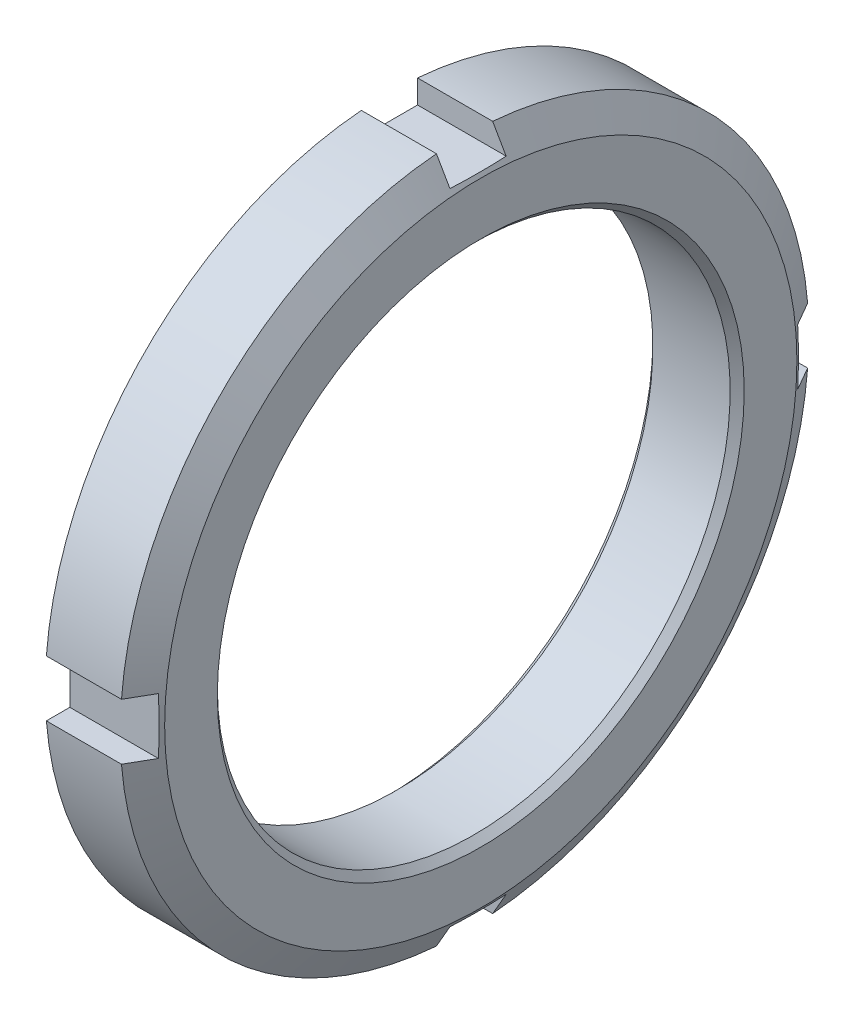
ISO-10303-21;
HEADER;
FILE_DESCRIPTION(('STEP AP214'),'2;1');
FILE_NAME('part.step','',(''),(''),'','','');
FILE_SCHEMA(('AUTOMOTIVE_DESIGN { 1 0 10303 214 1 1 1 1 }'));
ENDSEC;
DATA;
#1=APPLICATION_CONTEXT('core data for automotive mechanical design processes');
#2=APPLICATION_PROTOCOL_DEFINITION('international standard','automotive_design',2000,#1);
#3=PRODUCT_CONTEXT('',#1,'mechanical');
#4=PRODUCT('Part','Part','',(#3));
#5=PRODUCT_RELATED_PRODUCT_CATEGORY('part','',(#4));
#6=PRODUCT_DEFINITION_FORMATION('','',#4);
#7=PRODUCT_DEFINITION_CONTEXT('part definition',#1,'design');
#8=PRODUCT_DEFINITION('design','',#6,#7);
#9=PRODUCT_DEFINITION_SHAPE('','',#8);
#10=(LENGTH_UNIT() NAMED_UNIT(*) SI_UNIT(.MILLI.,.METRE.));
#11=(NAMED_UNIT(*) PLANE_ANGLE_UNIT() SI_UNIT($,.RADIAN.));
#12=(NAMED_UNIT(*) SI_UNIT($,.STERADIAN.) SOLID_ANGLE_UNIT());
#13=UNCERTAINTY_MEASURE_WITH_UNIT(LENGTH_MEASURE(1.E-05),#10,'distance_accuracy_value','');
#14=(GEOMETRIC_REPRESENTATION_CONTEXT(3) GLOBAL_UNCERTAINTY_ASSIGNED_CONTEXT((#13)) GLOBAL_UNIT_ASSIGNED_CONTEXT((#10,
#11,#12)) REPRESENTATION_CONTEXT('',''));
#15=CARTESIAN_POINT('',(0.,0.,0.));
#16=DIRECTION('',(0.,0.,1.));
#17=DIRECTION('',(1.,0.,0.));
#18=AXIS2_PLACEMENT_3D('',#15,#16,#17);
#19=CARTESIAN_POINT('',(13.,0.,0.));
#20=DIRECTION('',(-1.,0.,0.));
#21=DIRECTION('',(0.,0.,1.));
#22=AXIS2_PLACEMENT_3D('',#19,#20,#21);
#23=CYLINDRICAL_SURFACE('',#22,49.);
#24=CARTESIAN_POINT('',(0.,0.,0.));
#25=DIRECTION('',(-1.,0.,0.));
#26=DIRECTION('',(0.,0.,1.));
#27=AXIS2_PLACEMENT_3D('',#24,#25,#26);
#28=CIRCLE('',#27,49.);
#29=CARTESIAN_POINT('',(0.,4.,48.8364617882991));
#30=VERTEX_POINT('',#29);
#31=CARTESIAN_POINT('',(0.,48.8364617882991,4.));
#32=VERTEX_POINT('',#31);
#33=EDGE_CURVE('E250',#30,#32,#28,.T.);
#34=ORIENTED_EDGE('',*,*,#33,.F.);
#35=DIRECTION('',(-1.,0.,0.));
#36=VECTOR('',#35,1.);
#37=CARTESIAN_POINT('',(13.,4.,48.8364617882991));
#38=LINE('',#37,#36);
#39=CARTESIAN_POINT('',(10.6905989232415,4.,48.8364617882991));
#40=VERTEX_POINT('',#39);
#41=EDGE_CURVE('E153',#30,#40,#38,.F.);
#42=ORIENTED_EDGE('',*,*,#41,.T.);
#43=CARTESIAN_POINT('',(10.6905989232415,0.,0.));
#44=DIRECTION('',(-1.,0.,0.));
#45=DIRECTION('',(0.,0.,1.));
#46=AXIS2_PLACEMENT_3D('',#43,#44,#45);
#47=CIRCLE('',#46,49.);
#48=CARTESIAN_POINT('',(10.6905989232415,48.8364617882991,4.));
#49=VERTEX_POINT('',#48);
#50=EDGE_CURVE('E245',#40,#49,#47,.T.);
#51=ORIENTED_EDGE('',*,*,#50,.T.);
#52=DIRECTION('',(-1.,0.,0.));
#53=VECTOR('',#52,1.);
#54=CARTESIAN_POINT('',(13.,48.8364617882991,4.));
#55=LINE('',#54,#53);
#56=EDGE_CURVE('E166',#49,#32,#55,.T.);
#57=ORIENTED_EDGE('',*,*,#56,.T.);
#58=EDGE_LOOP('',(#34,#42,#51,#57));
#59=FACE_BOUND('',#58,.T.);
#60=ADVANCED_FACE('F30',(#59),#23,.T.);
#61=CARTESIAN_POINT('',(10.6905989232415,-48.8364617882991,4.));
#62=VERTEX_POINT('',#61);
#63=CARTESIAN_POINT('',(10.6905989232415,-4.,48.8364617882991));
#64=VERTEX_POINT('',#63);
#65=EDGE_CURVE('E244',#62,#64,#47,.T.);
#66=ORIENTED_EDGE('',*,*,#65,.T.);
#67=DIRECTION('',(-1.,0.,0.));
#68=VECTOR('',#67,1.);
#69=CARTESIAN_POINT('',(13.,-4.,48.8364617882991));
#70=LINE('',#69,#68);
#71=CARTESIAN_POINT('',(0.,-4.,48.8364617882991));
#72=VERTEX_POINT('',#71);
#73=EDGE_CURVE('E50',#64,#72,#70,.T.);
#74=ORIENTED_EDGE('',*,*,#73,.T.);
#75=CARTESIAN_POINT('',(0.,-48.8364617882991,4.));
#76=VERTEX_POINT('',#75);
#77=EDGE_CURVE('E248',#76,#72,#28,.T.);
#78=ORIENTED_EDGE('',*,*,#77,.F.);
#79=DIRECTION('',(-1.,0.,0.));
#80=VECTOR('',#79,1.);
#81=CARTESIAN_POINT('',(13.,-48.8364617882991,4.));
#82=LINE('',#81,#80);
#83=EDGE_CURVE('E224',#76,#62,#82,.F.);
#84=ORIENTED_EDGE('',*,*,#83,.T.);
#85=EDGE_LOOP('',(#66,#74,#78,#84));
#86=FACE_BOUND('',#85,.T.);
#87=ADVANCED_FACE('F370',(#86),#23,.T.);
#88=CARTESIAN_POINT('',(10.6905989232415,-4.,-48.8364617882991));
#89=VERTEX_POINT('',#88);
#90=CARTESIAN_POINT('',(10.6905989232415,-48.8364617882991,-4.));
#91=VERTEX_POINT('',#90);
#92=EDGE_CURVE('E372',#89,#91,#47,.T.);
#93=ORIENTED_EDGE('',*,*,#92,.T.);
#94=DIRECTION('',(-1.,0.,0.));
#95=VECTOR('',#94,1.);
#96=CARTESIAN_POINT('',(13.,-48.8364617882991,-4.));
#97=LINE('',#96,#95);
#98=CARTESIAN_POINT('',(0.,-48.8364617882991,-4.));
#99=VERTEX_POINT('',#98);
#100=EDGE_CURVE('E58',#91,#99,#97,.T.);
#101=ORIENTED_EDGE('',*,*,#100,.T.);
#102=CARTESIAN_POINT('',(0.,-4.,-48.8364617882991));
#103=VERTEX_POINT('',#102);
#104=EDGE_CURVE('E392',#103,#99,#28,.T.);
#105=ORIENTED_EDGE('',*,*,#104,.F.);
#106=DIRECTION('',(-1.,0.,0.));
#107=VECTOR('',#106,1.);
#108=CARTESIAN_POINT('',(13.,-4.,-48.8364617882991));
#109=LINE('',#108,#107);
#110=EDGE_CURVE('E220',#103,#89,#109,.F.);
#111=ORIENTED_EDGE('',*,*,#110,.T.);
#112=EDGE_LOOP('',(#93,#101,#105,#111));
#113=FACE_BOUND('',#112,.T.);
#114=ADVANCED_FACE('F401',(#113),#23,.T.);
#115=CARTESIAN_POINT('',(0.,0.,0.));
#116=DIRECTION('',(1.,0.,0.));
#117=DIRECTION('',(0.,0.,-1.));
#118=AXIS2_PLACEMENT_3D('',#115,#116,#117);
#119=PLANE('',#118);
#120=DIRECTION('',(0.,-1.,0.));
#121=VECTOR('',#120,1.);
#122=CARTESIAN_POINT('',(0.,4.,45.5));
#123=LINE('',#122,#121);
#124=CARTESIAN_POINT('',(0.,4.,45.5));
#125=VERTEX_POINT('',#124);
#126=CARTESIAN_POINT('',(0.,-4.,45.5));
#127=VERTEX_POINT('',#126);
#128=EDGE_CURVE('E158',#125,#127,#123,.T.);
#129=ORIENTED_EDGE('',*,*,#128,.F.);
#130=DIRECTION('',(0.,0.,-1.));
#131=VECTOR('',#130,1.);
#132=CARTESIAN_POINT('',(0.,4.,49.));
#133=LINE('',#132,#131);
#134=EDGE_CURVE('E148',#30,#125,#133,.T.);
#135=ORIENTED_EDGE('',*,*,#134,.F.);
#136=ORIENTED_EDGE('',*,*,#33,.T.);
#137=DIRECTION('',(0.,1.,0.));
#138=VECTOR('',#137,1.);
#139=CARTESIAN_POINT('',(0.,45.5,4.));
#140=LINE('',#139,#138);
#141=CARTESIAN_POINT('',(0.,45.5,4.));
#142=VERTEX_POINT('',#141);
#143=EDGE_CURVE('E194',#142,#32,#140,.T.);
#144=ORIENTED_EDGE('',*,*,#143,.F.);
#145=DIRECTION('',(0.,0.,1.));
#146=VECTOR('',#145,1.);
#147=CARTESIAN_POINT('',(0.,45.5,-4.));
#148=LINE('',#147,#146);
#149=CARTESIAN_POINT('',(0.,45.5,-4.));
#150=VERTEX_POINT('',#149);
#151=EDGE_CURVE('E191',#150,#142,#148,.T.);
#152=ORIENTED_EDGE('',*,*,#151,.F.);
#153=DIRECTION('',(0.,-1.,0.));
#154=VECTOR('',#153,1.);
#155=CARTESIAN_POINT('',(0.,49.,-4.));
#156=LINE('',#155,#154);
#157=CARTESIAN_POINT('',(0.,48.8364617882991,-4.));
#158=VERTEX_POINT('',#157);
#159=EDGE_CURVE('E189',#158,#150,#156,.T.);
#160=ORIENTED_EDGE('',*,*,#159,.F.);
#161=CARTESIAN_POINT('',(0.,4.,-48.8364617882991));
#162=VERTEX_POINT('',#161);
#163=EDGE_CURVE('E253',#158,#162,#28,.T.);
#164=ORIENTED_EDGE('',*,*,#163,.T.);
#165=DIRECTION('',(0.,0.,-1.));
#166=VECTOR('',#165,1.);
#167=CARTESIAN_POINT('',(0.,4.,-45.5));
#168=LINE('',#167,#166);
#169=CARTESIAN_POINT('',(0.,4.,-45.5));
#170=VERTEX_POINT('',#169);
#171=EDGE_CURVE('E187',#170,#162,#168,.T.);
#172=ORIENTED_EDGE('',*,*,#171,.F.);
#173=DIRECTION('',(0.,1.,0.));
#174=VECTOR('',#173,1.);
#175=CARTESIAN_POINT('',(0.,-4.,-45.5));
#176=LINE('',#175,#174);
#177=CARTESIAN_POINT('',(0.,-4.,-45.5));
#178=VERTEX_POINT('',#177);
#179=EDGE_CURVE('E184',#178,#170,#176,.T.);
#180=ORIENTED_EDGE('',*,*,#179,.F.);
#181=DIRECTION('',(0.,0.,1.));
#182=VECTOR('',#181,1.);
#183=CARTESIAN_POINT('',(0.,-4.,-49.));
#184=LINE('',#183,#182);
#185=EDGE_CURVE('E182',#103,#178,#184,.T.);
#186=ORIENTED_EDGE('',*,*,#185,.F.);
#187=ORIENTED_EDGE('',*,*,#104,.T.);
#188=DIRECTION('',(0.,-1.,0.));
#189=VECTOR('',#188,1.);
#190=CARTESIAN_POINT('',(0.,-45.5,-4.));
#191=LINE('',#190,#189);
#192=CARTESIAN_POINT('',(0.,-45.5,-4.));
#193=VERTEX_POINT('',#192);
#194=EDGE_CURVE('E180',#193,#99,#191,.T.);
#195=ORIENTED_EDGE('',*,*,#194,.F.);
#196=DIRECTION('',(0.,0.,-1.));
#197=VECTOR('',#196,1.);
#198=CARTESIAN_POINT('',(0.,-45.5,4.));
#199=LINE('',#198,#197);
#200=CARTESIAN_POINT('',(0.,-45.5,4.));
#201=VERTEX_POINT('',#200);
#202=EDGE_CURVE('E177',#201,#193,#199,.T.);
#203=ORIENTED_EDGE('',*,*,#202,.F.);
#204=DIRECTION('',(0.,1.,0.));
#205=VECTOR('',#204,1.);
#206=CARTESIAN_POINT('',(0.,-49.,4.));
#207=LINE('',#206,#205);
#208=EDGE_CURVE('E173',#76,#201,#207,.T.);
#209=ORIENTED_EDGE('',*,*,#208,.F.);
#210=ORIENTED_EDGE('',*,*,#77,.T.);
#211=DIRECTION('',(0.,0.,1.));
#212=VECTOR('',#211,1.);
#213=CARTESIAN_POINT('',(0.,-4.,45.5));
#214=LINE('',#213,#212);
#215=EDGE_CURVE('E171',#127,#72,#214,.T.);
#216=ORIENTED_EDGE('',*,*,#215,.F.);
#217=EDGE_LOOP('',(#129,#135,#136,#144,#152,#160,#164,#172,#180,#186,#187,#195,#203,#209,#210,#216));
#218=FACE_BOUND('',#217,.T.);
#219=CARTESIAN_POINT('',(0.,0.,0.));
#220=DIRECTION('',(-1.,0.,0.));
#221=DIRECTION('',(0.,0.,1.));
#222=AXIS2_PLACEMENT_3D('',#219,#220,#221);
#223=CIRCLE('',#222,37.5);
#224=CARTESIAN_POINT('',(0.,0.,37.5));
#225=VERTEX_POINT('',#224);
#226=EDGE_CURVE('E238',#225,#225,#223,.T.);
#227=ORIENTED_EDGE('',*,*,#226,.F.);
#228=EDGE_LOOP('',(#227));
#229=FACE_BOUND('',#228,.T.);
#230=ADVANCED_FACE('F32',(#218,#229),#119,.F.);
#231=CARTESIAN_POINT('',(13.,45.,0.));
#232=DIRECTION('',(-1.,0.,0.));
#233=DIRECTION('',(0.,0.,1.));
#234=AXIS2_PLACEMENT_3D('',#231,#232,#233);
#235=PLANE('',#234);
#236=CARTESIAN_POINT('',(13.,0.,0.));
#237=DIRECTION('',(-1.,0.,0.));
#238=DIRECTION('',(0.,0.,1.));
#239=AXIS2_PLACEMENT_3D('',#236,#237,#238);
#240=CIRCLE('',#239,45.);
#241=CARTESIAN_POINT('',(13.,0.,45.));
#242=VERTEX_POINT('',#241);
#243=EDGE_CURVE('E241',#242,#242,#240,.T.);
#244=ORIENTED_EDGE('',*,*,#243,.F.);
#245=EDGE_LOOP('',(#244));
#246=FACE_BOUND('',#245,.T.);
#247=CARTESIAN_POINT('',(13.,0.,0.));
#248=DIRECTION('',(-1.,0.,0.));
#249=DIRECTION('',(0.,0.,1.));
#250=AXIS2_PLACEMENT_3D('',#247,#248,#249);
#251=CIRCLE('',#250,37.5);
#252=CARTESIAN_POINT('',(13.,0.,37.5));
#253=VERTEX_POINT('',#252);
#254=EDGE_CURVE('E229',#253,#253,#251,.T.);
#255=ORIENTED_EDGE('',*,*,#254,.T.);
#256=EDGE_LOOP('',(#255));
#257=FACE_BOUND('',#256,.T.);
#258=ADVANCED_FACE('F407',(#246,#257),#235,.F.);
#259=CARTESIAN_POINT('',(10.6905989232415,48.8364617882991,-4.));
#260=VERTEX_POINT('',#259);
#261=CARTESIAN_POINT('',(10.6905989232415,4.,-48.8364617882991));
#262=VERTEX_POINT('',#261);
#263=EDGE_CURVE('E249',#260,#262,#47,.T.);
#264=ORIENTED_EDGE('',*,*,#263,.T.);
#265=DIRECTION('',(-1.,0.,0.));
#266=VECTOR('',#265,1.);
#267=CARTESIAN_POINT('',(13.,4.,-48.8364617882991));
#268=LINE('',#267,#266);
#269=EDGE_CURVE('E217',#262,#162,#268,.T.);
#270=ORIENTED_EDGE('',*,*,#269,.T.);
#271=ORIENTED_EDGE('',*,*,#163,.F.);
#272=DIRECTION('',(-1.,0.,0.));
#273=VECTOR('',#272,1.);
#274=CARTESIAN_POINT('',(13.,48.8364617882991,-4.));
#275=LINE('',#274,#273);
#276=EDGE_CURVE('E214',#158,#260,#275,.F.);
#277=ORIENTED_EDGE('',*,*,#276,.T.);
#278=EDGE_LOOP('',(#264,#270,#271,#277));
#279=FACE_BOUND('',#278,.T.);
#280=ADVANCED_FACE('F379',(#279),#23,.T.);
#281=CARTESIAN_POINT('',(13.,0.,0.));
#282=DIRECTION('',(-1.,0.,0.));
#283=DIRECTION('',(0.,0.,1.));
#284=AXIS2_PLACEMENT_3D('',#281,#282,#283);
#285=CONICAL_SURFACE('',#284,45.,1.0471975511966);
#286=ORIENTED_EDGE('',*,*,#50,.F.);
#287=CARTESIAN_POINT('',(7.66285743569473,4.,54.0965198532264));
#288=CARTESIAN_POINT('',(8.33743228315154,4.,52.9249278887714));
#289=CARTESIAN_POINT('',(9.01192138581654,4.,51.7532865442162));
#290=CARTESIAN_POINT('',(10.3606797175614,4.,49.4098773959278));
#291=CARTESIAN_POINT('',(11.0349489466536,4.,48.2381095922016));
#292=CARTESIAN_POINT('',(12.3832192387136,4.,45.8944196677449));
#293=CARTESIAN_POINT('',(13.0572203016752,4.,44.7224975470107));
#294=CARTESIAN_POINT('',(14.4048782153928,4.,42.3784553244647));
#295=CARTESIAN_POINT('',(15.0785350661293,4.,41.2063352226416));
#296=CARTESIAN_POINT('',(15.7519817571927,4.,40.0340943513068));
#297=B_SPLINE_CURVE_WITH_KNOTS('',3,(#287,#288,#289,#290,#291,#292,#293,#294,#295,#296),
.UNSPECIFIED.,.F.,.F.,(4,2,2,2,4),(0.,4.05575032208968,8.11150041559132,12.1672506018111,
16.223001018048),.UNSPECIFIED.);
#298=CARTESIAN_POINT('',(12.6100081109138,4.,45.5));
#299=VERTEX_POINT('',#298);
#300=EDGE_CURVE('E11',#40,#299,#297,.T.);
#301=ORIENTED_EDGE('',*,*,#300,.T.);
#302=CARTESIAN_POINT('',(11.6602653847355,12.9991778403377,45.5));
#303=CARTESIAN_POINT('',(11.765748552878,12.334181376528,45.5));
#304=CARTESIAN_POINT('',(11.8639087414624,11.6680083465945,45.5));
#305=CARTESIAN_POINT('',(12.0449590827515,10.3335596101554,45.5));
#306=CARTESIAN_POINT('',(12.1278484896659,9.66528380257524,45.5));
#307=CARTESIAN_POINT('',(12.2777398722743,8.32679221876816,45.5));
#308=CARTESIAN_POINT('',(12.3447382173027,7.65657603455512,45.5));
#309=CARTESIAN_POINT('',(12.4623039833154,6.31471161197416,45.5));
#310=CARTESIAN_POINT('',(12.5128716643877,5.6430633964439,45.5));
#311=CARTESIAN_POINT('',(12.5967702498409,4.30502342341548,45.5));
#312=CARTESIAN_POINT('',(12.630258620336,3.63864156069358,45.5));
#313=CARTESIAN_POINT('',(12.6804361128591,2.3052241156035,45.5));
#314=CARTESIAN_POINT('',(12.6971247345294,1.63818851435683,45.5));
#315=CARTESIAN_POINT('',(12.7135599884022,0.304026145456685,45.5));
#316=CARTESIAN_POINT('',(12.7133096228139,-0.363100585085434,45.5));
#317=CARTESIAN_POINT('',(12.6958767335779,-1.69715353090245,45.5));
#318=CARTESIAN_POINT('',(12.6786936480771,-2.36407973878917,45.5));
#319=CARTESIAN_POINT('',(12.6275573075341,-3.69672963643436,45.5));
#320=CARTESIAN_POINT('',(12.5936181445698,-4.36245386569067,45.5));
#321=CARTESIAN_POINT('',(12.5092599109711,-5.69286439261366,45.5));
#322=CARTESIAN_POINT('',(12.45884030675,-6.35755065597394,45.5));
#323=CARTESIAN_POINT('',(12.2834101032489,-8.34967587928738,45.5));
#324=CARTESIAN_POINT('',(12.1342333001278,-9.67504956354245,45.5));
#325=CARTESIAN_POINT('',(11.7741385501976,-12.3301774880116,45.5));
#326=CARTESIAN_POINT('',(11.5626446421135,-13.6598527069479,45.5));
#327=CARTESIAN_POINT('',(11.2038795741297,-15.6464494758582,45.5));
#328=CARTESIAN_POINT('',(11.0773985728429,-16.3072038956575,45.5));
#329=CARTESIAN_POINT('',(10.8113610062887,-17.6260365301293,45.5));
#330=CARTESIAN_POINT('',(10.6718052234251,-18.2841149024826,45.5));
#331=CARTESIAN_POINT('',(10.5260896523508,-18.9408329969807,45.5));
#332=B_SPLINE_CURVE_WITH_KNOTS('',3,(#302,#303,#304,#305,#306,#307,#308,#309,#310,#311,#312,
#313,#314,#315,#316,#317,#318,#319,#320,#321,#322,#323,#324,#325,#326,#327,#328,#329,#330,#331),
.UNSPECIFIED.,.F.,.F.,(4,2,2,2,2,2,2,2,2,2,2,2,2,2,4),(0.,2.019912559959,4.03992374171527,
6.06039599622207,8.08083626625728,10.0822957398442,12.083814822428,14.0849791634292,
16.0862099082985,18.0857604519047,20.0853757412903,24.0850013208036,28.1228191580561,
30.1409590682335,32.1589782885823),.UNSPECIFIED.);
#333=CARTESIAN_POINT('',(12.6100081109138,-4.,45.5));
#334=VERTEX_POINT('',#333);
#335=EDGE_CURVE('E43',#299,#334,#332,.T.);
#336=ORIENTED_EDGE('',*,*,#335,.T.);
#337=CARTESIAN_POINT('',(15.7519817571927,-4.,40.0340943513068));
#338=CARTESIAN_POINT('',(15.0785350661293,-4.,41.2063352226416));
#339=CARTESIAN_POINT('',(14.4048782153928,-4.,42.3784553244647));
#340=CARTESIAN_POINT('',(13.0572203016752,-4.,44.7224975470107));
#341=CARTESIAN_POINT('',(12.3832192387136,-4.,45.8944196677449));
#342=CARTESIAN_POINT('',(11.0349489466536,-4.,48.2381095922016));
#343=CARTESIAN_POINT('',(10.3606797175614,-4.,49.4098773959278));
#344=CARTESIAN_POINT('',(9.01192138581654,-4.,51.7532865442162));
#345=CARTESIAN_POINT('',(8.33743228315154,-4.,52.9249278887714));
#346=CARTESIAN_POINT('',(7.66285743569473,-4.,54.0965198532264));
#347=B_SPLINE_CURVE_WITH_KNOTS('',3,(#337,#338,#339,#340,#341,#342,#343,#344,#345,#346),
.UNSPECIFIED.,.F.,.F.,(4,2,2,2,4),(0.,4.05575041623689,8.11150060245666,12.1672506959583,
16.223001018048),.UNSPECIFIED.);
#348=EDGE_CURVE('E344',#334,#64,#347,.T.);
#349=ORIENTED_EDGE('',*,*,#348,.T.);
#350=ORIENTED_EDGE('',*,*,#65,.F.);
#351=CARTESIAN_POINT('',(6.90593146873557,-55.4110483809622,4.));
#352=CARTESIAN_POINT('',(7.58057111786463,-54.2394937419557,4.));
#353=CARTESIAN_POINT('',(8.25513078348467,-53.0678930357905,4.));
#354=CARTESIAN_POINT('',(9.60404651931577,-50.7245745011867,4.));
#355=CARTESIAN_POINT('',(10.2784025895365,-49.5528566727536,4.));
#356=CARTESIAN_POINT('',(11.6268675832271,-47.2092787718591,4.));
#357=CARTESIAN_POINT('',(12.3009765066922,-46.0374186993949,4.));
#358=CARTESIAN_POINT('',(13.6488794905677,-43.6935174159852,4.));
#359=CARTESIAN_POINT('',(14.322673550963,-42.521476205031,4.));
#360=CARTESIAN_POINT('',(14.9962762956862,-41.3493250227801,4.));
#361=B_SPLINE_CURVE_WITH_KNOTS('',3,(#351,#352,#353,#354,#355,#356,#357,#358,#359,#360),
.UNSPECIFIED.,.F.,.F.,(4,2,2,2,4),(0.,4.05575028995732,8.1115003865,12.1672505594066,
16.2230009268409),.UNSPECIFIED.);
#362=CARTESIAN_POINT('',(12.6100081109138,-45.5,4.));
#363=VERTEX_POINT('',#362);
#364=EDGE_CURVE('E338',#62,#363,#361,.T.);
#365=ORIENTED_EDGE('',*,*,#364,.T.);
#366=CARTESIAN_POINT('',(11.6602653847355,-45.5,12.9991778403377));
#367=CARTESIAN_POINT('',(11.765748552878,-45.5,12.334181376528));
#368=CARTESIAN_POINT('',(11.8639087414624,-45.5,11.6680083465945));
#369=CARTESIAN_POINT('',(12.0449590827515,-45.5,10.3335596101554));
#370=CARTESIAN_POINT('',(12.1278484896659,-45.5,9.66528380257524));
#371=CARTESIAN_POINT('',(12.2777398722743,-45.5,8.32679221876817));
#372=CARTESIAN_POINT('',(12.3447382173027,-45.5,7.65657603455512));
#373=CARTESIAN_POINT('',(12.4623039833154,-45.5,6.31471161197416));
#374=CARTESIAN_POINT('',(12.5128716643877,-45.5,5.6430633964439));
#375=CARTESIAN_POINT('',(12.5967702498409,-45.5,4.30502342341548));
#376=CARTESIAN_POINT('',(12.630258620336,-45.5,3.63864156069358));
#377=CARTESIAN_POINT('',(12.6804361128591,-45.5,2.3052241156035));
#378=CARTESIAN_POINT('',(12.6971247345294,-45.5,1.63818851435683));
#379=CARTESIAN_POINT('',(12.7135599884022,-45.5,0.304026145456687));
#380=CARTESIAN_POINT('',(12.7133096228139,-45.5,-0.363100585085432));
#381=CARTESIAN_POINT('',(12.6958767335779,-45.5,-1.69715353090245));
#382=CARTESIAN_POINT('',(12.6786936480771,-45.5,-2.36407973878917));
#383=CARTESIAN_POINT('',(12.6275573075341,-45.5,-3.69672963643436));
#384=CARTESIAN_POINT('',(12.5936181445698,-45.5,-4.36245386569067));
#385=CARTESIAN_POINT('',(12.5092599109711,-45.5,-5.69286439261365));
#386=CARTESIAN_POINT('',(12.45884030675,-45.5,-6.35755065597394));
#387=CARTESIAN_POINT('',(12.2834101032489,-45.5,-8.34967587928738));
#388=CARTESIAN_POINT('',(12.1342333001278,-45.5,-9.67504956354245));
#389=CARTESIAN_POINT('',(11.7741385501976,-45.5,-12.3301774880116));
#390=CARTESIAN_POINT('',(11.5626446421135,-45.5,-13.6598527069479));
#391=CARTESIAN_POINT('',(11.2038795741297,-45.5,-15.6464494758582));
#392=CARTESIAN_POINT('',(11.0773985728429,-45.5,-16.3072038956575));
#393=CARTESIAN_POINT('',(10.8113610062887,-45.5,-17.6260365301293));
#394=CARTESIAN_POINT('',(10.6718052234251,-45.5,-18.2841149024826));
#395=CARTESIAN_POINT('',(10.5260896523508,-45.5,-18.9408329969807));
#396=B_SPLINE_CURVE_WITH_KNOTS('',3,(#366,#367,#368,#369,#370,#371,#372,#373,#374,#375,#376,
#377,#378,#379,#380,#381,#382,#383,#384,#385,#386,#387,#388,#389,#390,#391,#392,#393,#394,#395),
.UNSPECIFIED.,.F.,.F.,(4,2,2,2,2,2,2,2,2,2,2,2,2,2,4),(0.,2.019912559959,4.03992374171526,
6.06039599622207,8.08083626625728,10.0822957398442,12.083814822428,14.0849791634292,
16.0862099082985,18.0857604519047,20.0853757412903,24.0850013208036,28.1228191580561,
30.1409590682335,32.1589782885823),.UNSPECIFIED.);
#397=CARTESIAN_POINT('',(12.6100081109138,-45.5,-4.));
#398=VERTEX_POINT('',#397);
#399=EDGE_CURVE('E332',#363,#398,#396,.T.);
#400=ORIENTED_EDGE('',*,*,#399,.T.);
#401=CARTESIAN_POINT('',(14.9962762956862,-41.3493250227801,-4.));
#402=CARTESIAN_POINT('',(14.322673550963,-42.521476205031,-4.));
#403=CARTESIAN_POINT('',(13.6488794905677,-43.6935174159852,-4.));
#404=CARTESIAN_POINT('',(12.3009765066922,-46.0374186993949,-4.));
#405=CARTESIAN_POINT('',(11.6268675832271,-47.2092787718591,-4.));
#406=CARTESIAN_POINT('',(10.2784025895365,-49.5528566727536,-4.));
#407=CARTESIAN_POINT('',(9.60404651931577,-50.7245745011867,-4.));
#408=CARTESIAN_POINT('',(8.25513078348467,-53.0678930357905,-4.));
#409=CARTESIAN_POINT('',(7.58057111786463,-54.2394937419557,-4.));
#410=CARTESIAN_POINT('',(6.90593146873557,-55.4110483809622,-4.));
#411=B_SPLINE_CURVE_WITH_KNOTS('',3,(#401,#402,#403,#404,#405,#406,#407,#408,#409,#410),
.UNSPECIFIED.,.F.,.F.,(4,2,2,2,4),(0.,4.05575036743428,8.11150054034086,12.1672506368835,
16.2230009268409),.UNSPECIFIED.);
#412=EDGE_CURVE('E327',#398,#91,#411,.T.);
#413=ORIENTED_EDGE('',*,*,#412,.T.);
#414=ORIENTED_EDGE('',*,*,#92,.F.);
#415=CARTESIAN_POINT('',(6.90593146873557,-4.,-55.4110483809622));
#416=CARTESIAN_POINT('',(7.58057111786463,-4.,-54.2394937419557));
#417=CARTESIAN_POINT('',(8.25513078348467,-4.,-53.0678930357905));
#418=CARTESIAN_POINT('',(9.60404651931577,-4.,-50.7245745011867));
#419=CARTESIAN_POINT('',(10.2784025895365,-4.,-49.5528566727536));
#420=CARTESIAN_POINT('',(11.6268675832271,-4.,-47.2092787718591));
#421=CARTESIAN_POINT('',(12.3009765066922,-4.,-46.0374186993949));
#422=CARTESIAN_POINT('',(13.6488794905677,-4.,-43.6935174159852));
#423=CARTESIAN_POINT('',(14.322673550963,-4.,-42.521476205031));
#424=CARTESIAN_POINT('',(14.9962762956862,-4.,-41.3493250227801));
#425=B_SPLINE_CURVE_WITH_KNOTS('',3,(#415,#416,#417,#418,#419,#420,#421,#422,#423,#424),
.UNSPECIFIED.,.F.,.F.,(4,2,2,2,4),(0.,4.05575028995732,8.1115003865,12.1672505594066,
16.2230009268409),.UNSPECIFIED.);
#426=CARTESIAN_POINT('',(12.6100081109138,-4.,-45.5));
#427=VERTEX_POINT('',#426);
#428=EDGE_CURVE('E305',#89,#427,#425,.T.);
#429=ORIENTED_EDGE('',*,*,#428,.T.);
#430=CARTESIAN_POINT('',(10.5260896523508,-18.9408329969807,-45.5));
#431=CARTESIAN_POINT('',(10.6718052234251,-18.2841149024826,-45.5));
#432=CARTESIAN_POINT('',(10.8113610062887,-17.6260365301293,-45.5));
#433=CARTESIAN_POINT('',(11.0773985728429,-16.3072038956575,-45.5));
#434=CARTESIAN_POINT('',(11.2038795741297,-15.6464494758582,-45.5));
#435=CARTESIAN_POINT('',(11.5626446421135,-13.6598527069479,-45.5));
#436=CARTESIAN_POINT('',(11.7741385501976,-12.3301774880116,-45.5));
#437=CARTESIAN_POINT('',(12.1342333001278,-9.67504956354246,-45.5));
#438=CARTESIAN_POINT('',(12.2834101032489,-8.34967587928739,-45.5));
#439=CARTESIAN_POINT('',(12.45884030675,-6.35755065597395,-45.5));
#440=CARTESIAN_POINT('',(12.5092599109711,-5.69286439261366,-45.5));
#441=CARTESIAN_POINT('',(12.5936181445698,-4.36245386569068,-45.5));
#442=CARTESIAN_POINT('',(12.6275573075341,-3.69672963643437,-45.5));
#443=CARTESIAN_POINT('',(12.6786936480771,-2.36407973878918,-45.5));
#444=CARTESIAN_POINT('',(12.6958767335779,-1.69715353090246,-45.5));
#445=CARTESIAN_POINT('',(12.7133096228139,-0.36310058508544,-45.5));
#446=CARTESIAN_POINT('',(12.7135599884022,0.304026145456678,-45.5));
#447=CARTESIAN_POINT('',(12.6971247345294,1.63818851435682,-45.5));
#448=CARTESIAN_POINT('',(12.6804361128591,2.30522411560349,-45.5));
#449=CARTESIAN_POINT('',(12.630258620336,3.63864156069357,-45.5));
#450=CARTESIAN_POINT('',(12.5967702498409,4.30502342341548,-45.5));
#451=CARTESIAN_POINT('',(12.5128716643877,5.6430633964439,-45.5));
#452=CARTESIAN_POINT('',(12.4623039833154,6.31471161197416,-45.5));
#453=CARTESIAN_POINT('',(12.3447382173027,7.65657603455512,-45.5));
#454=CARTESIAN_POINT('',(12.2777398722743,8.32679221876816,-45.5));
#455=CARTESIAN_POINT('',(12.1278484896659,9.66528380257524,-45.5));
#456=CARTESIAN_POINT('',(12.0449590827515,10.3335596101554,-45.5));
#457=CARTESIAN_POINT('',(11.8639087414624,11.6680083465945,-45.5));
#458=CARTESIAN_POINT('',(11.765748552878,12.334181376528,-45.5));
#459=CARTESIAN_POINT('',(11.6602653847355,12.9991778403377,-45.5));
#460=B_SPLINE_CURVE_WITH_KNOTS('',3,(#430,#431,#432,#433,#434,#435,#436,#437,#438,#439,#440,
#441,#442,#443,#444,#445,#446,#447,#448,#449,#450,#451,#452,#453,#454,#455,#456,#457,#458,#459),
.UNSPECIFIED.,.F.,.F.,(4,2,2,2,2,2,2,2,2,2,2,2,2,2,4),(0.,2.01801922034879,4.03615913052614,
8.07397696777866,12.073602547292,14.0732178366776,16.0727683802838,18.0739991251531,
20.0751634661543,22.0766825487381,24.078142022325,26.0985822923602,28.119054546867,
30.1390657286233,32.1589782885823),.UNSPECIFIED.);
#461=CARTESIAN_POINT('',(12.6100081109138,4.,-45.5));
#462=VERTEX_POINT('',#461);
#463=EDGE_CURVE('E299',#427,#462,#460,.T.);
#464=ORIENTED_EDGE('',*,*,#463,.T.);
#465=CARTESIAN_POINT('',(14.9962762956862,4.,-41.3493250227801));
#466=CARTESIAN_POINT('',(14.322673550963,4.,-42.521476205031));
#467=CARTESIAN_POINT('',(13.6488794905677,4.,-43.6935174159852));
#468=CARTESIAN_POINT('',(12.3009765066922,4.,-46.0374186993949));
#469=CARTESIAN_POINT('',(11.6268675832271,4.,-47.2092787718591));
#470=CARTESIAN_POINT('',(10.2784025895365,4.,-49.5528566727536));
#471=CARTESIAN_POINT('',(9.60404651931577,4.,-50.7245745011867));
#472=CARTESIAN_POINT('',(8.25513078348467,4.,-53.0678930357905));
#473=CARTESIAN_POINT('',(7.58057111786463,4.,-54.2394937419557));
#474=CARTESIAN_POINT('',(6.90593146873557,4.,-55.4110483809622));
#475=B_SPLINE_CURVE_WITH_KNOTS('',3,(#465,#466,#467,#468,#469,#470,#471,#472,#473,#474),
.UNSPECIFIED.,.F.,.F.,(4,2,2,2,4),(0.,4.05575036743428,8.11150054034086,12.1672506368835,
16.2230009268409),.UNSPECIFIED.);
#476=EDGE_CURVE('E293',#462,#262,#475,.T.);
#477=ORIENTED_EDGE('',*,*,#476,.T.);
#478=ORIENTED_EDGE('',*,*,#263,.F.);
#479=CARTESIAN_POINT('',(7.66285743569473,54.0965198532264,-4.));
#480=CARTESIAN_POINT('',(8.33743228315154,52.9249278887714,-4.));
#481=CARTESIAN_POINT('',(9.01192138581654,51.7532865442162,-4.));
#482=CARTESIAN_POINT('',(10.3606797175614,49.4098773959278,-4.));
#483=CARTESIAN_POINT('',(11.0349489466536,48.2381095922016,-4.));
#484=CARTESIAN_POINT('',(12.3832192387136,45.8944196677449,-4.));
#485=CARTESIAN_POINT('',(13.0572203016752,44.7224975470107,-4.));
#486=CARTESIAN_POINT('',(14.4048782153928,42.3784553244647,-4.));
#487=CARTESIAN_POINT('',(15.0785350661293,41.2063352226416,-4.));
#488=CARTESIAN_POINT('',(15.7519817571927,40.0340943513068,-4.));
#489=B_SPLINE_CURVE_WITH_KNOTS('',3,(#479,#480,#481,#482,#483,#484,#485,#486,#487,#488),
.UNSPECIFIED.,.F.,.F.,(4,2,2,2,4),(0.,4.05575032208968,8.11150041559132,12.1672506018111,
16.223001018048),.UNSPECIFIED.);
#490=CARTESIAN_POINT('',(12.6100081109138,45.5,-4.));
#491=VERTEX_POINT('',#490);
#492=EDGE_CURVE('E287',#260,#491,#489,.T.);
#493=ORIENTED_EDGE('',*,*,#492,.T.);
#494=CARTESIAN_POINT('',(10.5260896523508,45.5,-18.9408329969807));
#495=CARTESIAN_POINT('',(10.6718052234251,45.5,-18.2841149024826));
#496=CARTESIAN_POINT('',(10.8113610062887,45.5,-17.6260365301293));
#497=CARTESIAN_POINT('',(11.0773985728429,45.5,-16.3072038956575));
#498=CARTESIAN_POINT('',(11.2038795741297,45.5,-15.6464494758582));
#499=CARTESIAN_POINT('',(11.5626446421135,45.5,-13.6598527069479));
#500=CARTESIAN_POINT('',(11.7741385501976,45.5,-12.3301774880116));
#501=CARTESIAN_POINT('',(12.1342333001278,45.5,-9.67504956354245));
#502=CARTESIAN_POINT('',(12.2834101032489,45.5,-8.34967587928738));
#503=CARTESIAN_POINT('',(12.45884030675,45.5,-6.35755065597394));
#504=CARTESIAN_POINT('',(12.5092599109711,45.5,-5.69286439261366));
#505=CARTESIAN_POINT('',(12.5936181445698,45.5,-4.36245386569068));
#506=CARTESIAN_POINT('',(12.6275573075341,45.5,-3.69672963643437));
#507=CARTESIAN_POINT('',(12.6786936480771,45.5,-2.36407973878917));
#508=CARTESIAN_POINT('',(12.6958767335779,45.5,-1.69715353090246));
#509=CARTESIAN_POINT('',(12.7133096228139,45.5,-0.363100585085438));
#510=CARTESIAN_POINT('',(12.7135599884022,45.5,0.304026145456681));
#511=CARTESIAN_POINT('',(12.6971247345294,45.5,1.63818851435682));
#512=CARTESIAN_POINT('',(12.6804361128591,45.5,2.30522411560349));
#513=CARTESIAN_POINT('',(12.630258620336,45.5,3.63864156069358));
#514=CARTESIAN_POINT('',(12.5967702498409,45.5,4.30502342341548));
#515=CARTESIAN_POINT('',(12.5128716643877,45.5,5.6430633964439));
#516=CARTESIAN_POINT('',(12.4623039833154,45.5,6.31471161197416));
#517=CARTESIAN_POINT('',(12.3447382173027,45.5,7.65657603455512));
#518=CARTESIAN_POINT('',(12.2777398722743,45.5,8.32679221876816));
#519=CARTESIAN_POINT('',(12.1278484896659,45.5,9.66528380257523));
#520=CARTESIAN_POINT('',(12.0449590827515,45.5,10.3335596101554));
#521=CARTESIAN_POINT('',(11.8639087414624,45.5,11.6680083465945));
#522=CARTESIAN_POINT('',(11.765748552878,45.5,12.334181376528));
#523=CARTESIAN_POINT('',(11.6602653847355,45.5,12.9991778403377));
#524=B_SPLINE_CURVE_WITH_KNOTS('',3,(#494,#495,#496,#497,#498,#499,#500,#501,#502,#503,#504,
#505,#506,#507,#508,#509,#510,#511,#512,#513,#514,#515,#516,#517,#518,#519,#520,#521,#522,#523),
.UNSPECIFIED.,.F.,.F.,(4,2,2,2,2,2,2,2,2,2,2,2,2,2,4),(0.,2.0180192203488,4.03615913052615,
8.07397696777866,12.073602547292,14.0732178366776,16.0727683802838,18.0739991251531,
20.0751634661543,22.0766825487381,24.078142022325,26.0985822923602,28.119054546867,
30.1390657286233,32.1589782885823),.UNSPECIFIED.);
#525=CARTESIAN_POINT('',(12.6100081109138,45.5,4.));
#526=VERTEX_POINT('',#525);
#527=EDGE_CURVE('E260',#491,#526,#524,.T.);
#528=ORIENTED_EDGE('',*,*,#527,.T.);
#529=CARTESIAN_POINT('',(15.7519817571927,40.0340943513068,4.));
#530=CARTESIAN_POINT('',(15.0785350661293,41.2063352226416,4.));
#531=CARTESIAN_POINT('',(14.4048782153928,42.3784553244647,4.));
#532=CARTESIAN_POINT('',(13.0572203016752,44.7224975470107,4.));
#533=CARTESIAN_POINT('',(12.3832192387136,45.8944196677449,4.));
#534=CARTESIAN_POINT('',(11.0349489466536,48.2381095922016,4.));
#535=CARTESIAN_POINT('',(10.3606797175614,49.4098773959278,4.));
#536=CARTESIAN_POINT('',(9.01192138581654,51.7532865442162,4.));
#537=CARTESIAN_POINT('',(8.33743228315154,52.9249278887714,4.));
#538=CARTESIAN_POINT('',(7.66285743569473,54.0965198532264,4.));
#539=B_SPLINE_CURVE_WITH_KNOTS('',3,(#529,#530,#531,#532,#533,#534,#535,#536,#537,#538),
.UNSPECIFIED.,.F.,.F.,(4,2,2,2,4),(0.,4.05575041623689,8.11150060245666,12.1672506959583,
16.223001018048),.UNSPECIFIED.);
#540=EDGE_CURVE('E252',#526,#49,#539,.T.);
#541=ORIENTED_EDGE('',*,*,#540,.T.);
#542=EDGE_LOOP('',(#286,#301,#336,#349,#350,#365,#400,#413,#414,#429,#464,#477,#478,#493,#528,#541));
#543=FACE_BOUND('',#542,.T.);
#544=ORIENTED_EDGE('',*,*,#243,.T.);
#545=EDGE_LOOP('',(#544));
#546=FACE_BOUND('',#545,.T.);
#547=ADVANCED_FACE('F266',(#543,#546),#285,.T.);
#548=CARTESIAN_POINT('',(1.,0.,0.));
#549=DIRECTION('',(-1.,0.,0.));
#550=DIRECTION('',(0.,0.,1.));
#551=AXIS2_PLACEMENT_3D('',#548,#549,#550);
#552=CONICAL_SURFACE('',#551,36.5,0.785398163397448);
#553=ORIENTED_EDGE('',*,*,#226,.T.);
#554=EDGE_LOOP('',(#553));
#555=FACE_BOUND('',#554,.T.);
#556=CARTESIAN_POINT('',(1.,0.,0.));
#557=DIRECTION('',(-1.,0.,0.));
#558=DIRECTION('',(0.,0.,1.));
#559=AXIS2_PLACEMENT_3D('',#556,#557,#558);
#560=CIRCLE('',#559,36.5);
#561=CARTESIAN_POINT('',(1.,0.,36.5));
#562=VERTEX_POINT('',#561);
#563=EDGE_CURVE('E235',#562,#562,#560,.T.);
#564=ORIENTED_EDGE('',*,*,#563,.F.);
#565=EDGE_LOOP('',(#564));
#566=FACE_BOUND('',#565,.T.);
#567=ADVANCED_FACE('F450',(#555,#566),#552,.F.);
#568=CARTESIAN_POINT('',(13.,0.,0.));
#569=DIRECTION('',(-1.,0.,0.));
#570=DIRECTION('',(0.,0.,1.));
#571=AXIS2_PLACEMENT_3D('',#568,#569,#570);
#572=CYLINDRICAL_SURFACE('',#571,36.5);
#573=ORIENTED_EDGE('',*,*,#563,.T.);
#574=EDGE_LOOP('',(#573));
#575=FACE_BOUND('',#574,.T.);
#576=CARTESIAN_POINT('',(12.,0.,0.));
#577=DIRECTION('',(-1.,0.,0.));
#578=DIRECTION('',(0.,0.,1.));
#579=AXIS2_PLACEMENT_3D('',#576,#577,#578);
#580=CIRCLE('',#579,36.5);
#581=CARTESIAN_POINT('',(12.,0.,36.5));
#582=VERTEX_POINT('',#581);
#583=EDGE_CURVE('E232',#582,#582,#580,.T.);
#584=ORIENTED_EDGE('',*,*,#583,.F.);
#585=EDGE_LOOP('',(#584));
#586=FACE_BOUND('',#585,.T.);
#587=ADVANCED_FACE('F532',(#575,#586),#572,.F.);
#588=CARTESIAN_POINT('',(13.,0.,0.));
#589=DIRECTION('',(1.,0.,0.));
#590=DIRECTION('',(0.,0.,-1.));
#591=AXIS2_PLACEMENT_3D('',#588,#589,#590);
#592=CONICAL_SURFACE('',#591,37.5,0.785398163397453);
#593=ORIENTED_EDGE('',*,*,#583,.T.);
#594=EDGE_LOOP('',(#593));
#595=FACE_BOUND('',#594,.T.);
#596=ORIENTED_EDGE('',*,*,#254,.F.);
#597=EDGE_LOOP('',(#596));
#598=FACE_BOUND('',#597,.T.);
#599=ADVANCED_FACE('F273',(#595,#598),#592,.F.);
#600=CARTESIAN_POINT('',(13.,45.5,4.));
#601=DIRECTION('',(0.,0.,1.));
#602=DIRECTION('',(1.,0.,0.));
#603=AXIS2_PLACEMENT_3D('',#600,#601,#602);
#604=PLANE('',#603);
#605=ORIENTED_EDGE('',*,*,#540,.F.);
#606=DIRECTION('',(-1.,0.,0.));
#607=VECTOR('',#606,1.);
#608=CARTESIAN_POINT('',(13.,45.5,4.));
#609=LINE('',#608,#607);
#610=EDGE_CURVE('E196',#526,#142,#609,.T.);
#611=ORIENTED_EDGE('',*,*,#610,.T.);
#612=ORIENTED_EDGE('',*,*,#143,.T.);
#613=ORIENTED_EDGE('',*,*,#56,.F.);
#614=EDGE_LOOP('',(#605,#611,#612,#613));
#615=FACE_BOUND('',#614,.T.);
#616=ADVANCED_FACE('F269',(#615),#604,.F.);
#617=CARTESIAN_POINT('',(13.,45.5,-4.));
#618=DIRECTION('',(0.,-1.,0.));
#619=DIRECTION('',(0.,0.,-1.));
#620=AXIS2_PLACEMENT_3D('',#617,#618,#619);
#621=PLANE('',#620);
#622=DIRECTION('',(-1.,0.,0.));
#623=VECTOR('',#622,1.);
#624=CARTESIAN_POINT('',(13.,45.5,-4.));
#625=LINE('',#624,#623);
#626=EDGE_CURVE('E198',#491,#150,#625,.T.);
#627=ORIENTED_EDGE('',*,*,#626,.T.);
#628=ORIENTED_EDGE('',*,*,#151,.T.);
#629=ORIENTED_EDGE('',*,*,#610,.F.);
#630=ORIENTED_EDGE('',*,*,#527,.F.);
#631=EDGE_LOOP('',(#627,#628,#629,#630));
#632=FACE_BOUND('',#631,.T.);
#633=ADVANCED_FACE('F272',(#632),#621,.F.);
#634=CARTESIAN_POINT('',(13.,49.,-4.));
#635=DIRECTION('',(0.,0.,-1.));
#636=DIRECTION('',(-1.,0.,0.));
#637=AXIS2_PLACEMENT_3D('',#634,#635,#636);
#638=PLANE('',#637);
#639=ORIENTED_EDGE('',*,*,#159,.T.);
#640=ORIENTED_EDGE('',*,*,#626,.F.);
#641=ORIENTED_EDGE('',*,*,#492,.F.);
#642=ORIENTED_EDGE('',*,*,#276,.F.);
#643=EDGE_LOOP('',(#639,#640,#641,#642));
#644=FACE_BOUND('',#643,.T.);
#645=ADVANCED_FACE('F278',(#644),#638,.F.);
#646=CARTESIAN_POINT('',(13.,4.,-45.5));
#647=DIRECTION('',(0.,1.,0.));
#648=DIRECTION('',(0.,0.,1.));
#649=AXIS2_PLACEMENT_3D('',#646,#647,#648);
#650=PLANE('',#649);
#651=ORIENTED_EDGE('',*,*,#476,.F.);
#652=DIRECTION('',(-1.,0.,0.));
#653=VECTOR('',#652,1.);
#654=CARTESIAN_POINT('',(13.,4.,-45.5));
#655=LINE('',#654,#653);
#656=EDGE_CURVE('E201',#462,#170,#655,.T.);
#657=ORIENTED_EDGE('',*,*,#656,.T.);
#658=ORIENTED_EDGE('',*,*,#171,.T.);
#659=ORIENTED_EDGE('',*,*,#269,.F.);
#660=EDGE_LOOP('',(#651,#657,#658,#659));
#661=FACE_BOUND('',#660,.T.);
#662=ADVANCED_FACE('F283',(#661),#650,.F.);
#663=CARTESIAN_POINT('',(13.,-4.,-45.5));
#664=DIRECTION('',(0.,0.,1.));
#665=DIRECTION('',(1.,0.,0.));
#666=AXIS2_PLACEMENT_3D('',#663,#664,#665);
#667=PLANE('',#666);
#668=DIRECTION('',(-1.,0.,0.));
#669=VECTOR('',#668,1.);
#670=CARTESIAN_POINT('',(13.,-4.,-45.5));
#671=LINE('',#670,#669);
#672=EDGE_CURVE('E203',#427,#178,#671,.T.);
#673=ORIENTED_EDGE('',*,*,#672,.T.);
#674=ORIENTED_EDGE('',*,*,#179,.T.);
#675=ORIENTED_EDGE('',*,*,#656,.F.);
#676=ORIENTED_EDGE('',*,*,#463,.F.);
#677=EDGE_LOOP('',(#673,#674,#675,#676));
#678=FACE_BOUND('',#677,.T.);
#679=ADVANCED_FACE('F311',(#678),#667,.F.);
#680=CARTESIAN_POINT('',(13.,-4.,-49.));
#681=DIRECTION('',(0.,-1.,0.));
#682=DIRECTION('',(0.,0.,-1.));
#683=AXIS2_PLACEMENT_3D('',#680,#681,#682);
#684=PLANE('',#683);
#685=ORIENTED_EDGE('',*,*,#185,.T.);
#686=ORIENTED_EDGE('',*,*,#672,.F.);
#687=ORIENTED_EDGE('',*,*,#428,.F.);
#688=ORIENTED_EDGE('',*,*,#110,.F.);
#689=EDGE_LOOP('',(#685,#686,#687,#688));
#690=FACE_BOUND('',#689,.T.);
#691=ADVANCED_FACE('F314',(#690),#684,.F.);
#692=CARTESIAN_POINT('',(13.,-45.5,-4.));
#693=DIRECTION('',(0.,0.,-1.));
#694=DIRECTION('',(-1.,0.,0.));
#695=AXIS2_PLACEMENT_3D('',#692,#693,#694);
#696=PLANE('',#695);
#697=ORIENTED_EDGE('',*,*,#412,.F.);
#698=DIRECTION('',(-1.,0.,0.));
#699=VECTOR('',#698,1.);
#700=CARTESIAN_POINT('',(13.,-45.5,-4.));
#701=LINE('',#700,#699);
#702=EDGE_CURVE('E206',#398,#193,#701,.T.);
#703=ORIENTED_EDGE('',*,*,#702,.T.);
#704=ORIENTED_EDGE('',*,*,#194,.T.);
#705=ORIENTED_EDGE('',*,*,#100,.F.);
#706=EDGE_LOOP('',(#697,#703,#704,#705));
#707=FACE_BOUND('',#706,.T.);
#708=ADVANCED_FACE('F319',(#707),#696,.F.);
#709=CARTESIAN_POINT('',(13.,-45.5,4.));
#710=DIRECTION('',(0.,1.,0.));
#711=DIRECTION('',(0.,0.,1.));
#712=AXIS2_PLACEMENT_3D('',#709,#710,#711);
#713=PLANE('',#712);
#714=DIRECTION('',(-1.,0.,0.));
#715=VECTOR('',#714,1.);
#716=CARTESIAN_POINT('',(13.,-45.5,4.));
#717=LINE('',#716,#715);
#718=EDGE_CURVE('E208',#363,#201,#717,.T.);
#719=ORIENTED_EDGE('',*,*,#718,.T.);
#720=ORIENTED_EDGE('',*,*,#202,.T.);
#721=ORIENTED_EDGE('',*,*,#702,.F.);
#722=ORIENTED_EDGE('',*,*,#399,.F.);
#723=EDGE_LOOP('',(#719,#720,#721,#722));
#724=FACE_BOUND('',#723,.T.);
#725=ADVANCED_FACE('F324',(#724),#713,.F.);
#726=CARTESIAN_POINT('',(13.,-49.,4.));
#727=DIRECTION('',(0.,0.,1.));
#728=DIRECTION('',(1.,0.,0.));
#729=AXIS2_PLACEMENT_3D('',#726,#727,#728);
#730=PLANE('',#729);
#731=ORIENTED_EDGE('',*,*,#208,.T.);
#732=ORIENTED_EDGE('',*,*,#718,.F.);
#733=ORIENTED_EDGE('',*,*,#364,.F.);
#734=ORIENTED_EDGE('',*,*,#83,.F.);
#735=EDGE_LOOP('',(#731,#732,#733,#734));
#736=FACE_BOUND('',#735,.T.);
#737=ADVANCED_FACE('F349',(#736),#730,.F.);
#738=CARTESIAN_POINT('',(13.,4.,49.));
#739=DIRECTION('',(0.,1.,0.));
#740=DIRECTION('',(0.,0.,1.));
#741=AXIS2_PLACEMENT_3D('',#738,#739,#740);
#742=PLANE('',#741);
#743=ORIENTED_EDGE('',*,*,#134,.T.);
#744=DIRECTION('',(-1.,0.,0.));
#745=VECTOR('',#744,1.);
#746=CARTESIAN_POINT('',(13.,4.,45.5));
#747=LINE('',#746,#745);
#748=EDGE_CURVE('E151',#299,#125,#747,.T.);
#749=ORIENTED_EDGE('',*,*,#748,.F.);
#750=ORIENTED_EDGE('',*,*,#300,.F.);
#751=ORIENTED_EDGE('',*,*,#41,.F.);
#752=EDGE_LOOP('',(#743,#749,#750,#751));
#753=FACE_BOUND('',#752,.T.);
#754=ADVANCED_FACE('F150',(#753),#742,.F.);
#755=CARTESIAN_POINT('',(13.,4.,45.5));
#756=DIRECTION('',(0.,0.,-1.));
#757=DIRECTION('',(-1.,0.,0.));
#758=AXIS2_PLACEMENT_3D('',#755,#756,#757);
#759=PLANE('',#758);
#760=ORIENTED_EDGE('',*,*,#748,.T.);
#761=ORIENTED_EDGE('',*,*,#128,.T.);
#762=DIRECTION('',(-1.,0.,0.));
#763=VECTOR('',#762,1.);
#764=CARTESIAN_POINT('',(13.,-4.,45.5));
#765=LINE('',#764,#763);
#766=EDGE_CURVE('E167',#334,#127,#765,.T.);
#767=ORIENTED_EDGE('',*,*,#766,.F.);
#768=ORIENTED_EDGE('',*,*,#335,.F.);
#769=EDGE_LOOP('',(#760,#761,#767,#768));
#770=FACE_BOUND('',#769,.T.);
#771=ADVANCED_FACE('F162',(#770),#759,.F.);
#772=CARTESIAN_POINT('',(13.,-4.,45.5));
#773=DIRECTION('',(0.,-1.,0.));
#774=DIRECTION('',(0.,0.,-1.));
#775=AXIS2_PLACEMENT_3D('',#772,#773,#774);
#776=PLANE('',#775);
#777=ORIENTED_EDGE('',*,*,#348,.F.);
#778=ORIENTED_EDGE('',*,*,#766,.T.);
#779=ORIENTED_EDGE('',*,*,#215,.T.);
#780=ORIENTED_EDGE('',*,*,#73,.F.);
#781=EDGE_LOOP('',(#777,#778,#779,#780));
#782=FACE_BOUND('',#781,.T.);
#783=ADVANCED_FACE('F353',(#782),#776,.F.);
#784=CLOSED_SHELL('',(#60,#87,#114,#230,#258,#280,#547,#567,#587,#599,#616,#633,#645,#662,#679,
#691,#708,#725,#737,#754,#771,#783));
#785=MANIFOLD_SOLID_BREP('B2',#784);
#786=ADVANCED_BREP_SHAPE_REPRESENTATION('',(#18,#785),#14);
#787=SHAPE_DEFINITION_REPRESENTATION(#9,#786);
ENDSEC;
END-ISO-10303-21;
